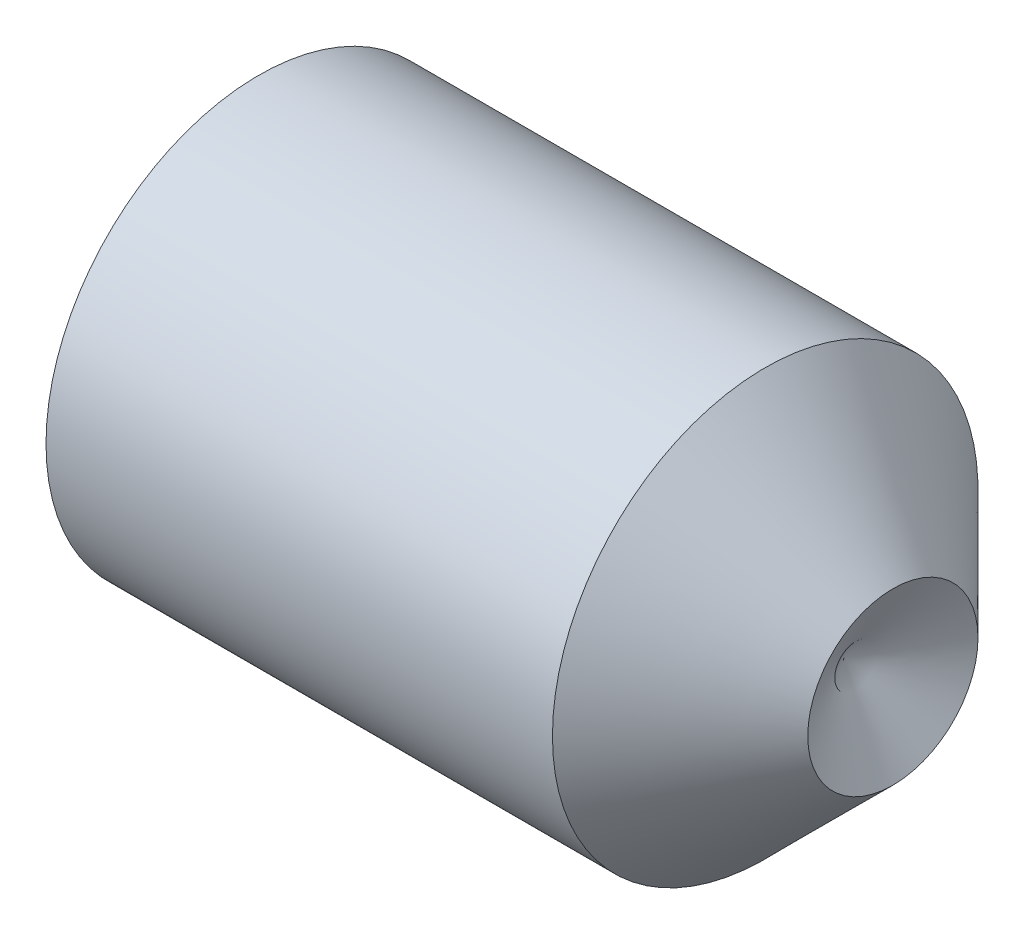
from build123d import *

# Parameters (mm, degrees)
HEX_2_DEPTH = 1.7


with BuildPart() as part:
    # BodySke → BaseBody (revolve)
    with BuildSketch(Plane.XY, mode=Mode.PRIVATE) as basebody_sk:
        Polygon((0, 0), (0, 0.774), (0.274818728, 1.25), (3.25, 1.25), (4, 0.5), (3.711324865, 0), align=None)
    revolve(basebody_sk.sketch.rotate(Axis((-12.7, 0, 0), (1, 0, 0)), 90), axis=Axis((-12.7, 0, 0), (1, 0, 0)))

    # Sketch2 → Hex 2 (cut)
    with BuildSketch(Plane.ZY):
        Polygon((0.259807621, 0.45), (-0.259807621, 0.45), (-0.519615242, 0), (-0.259807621, -0.45), (0.259807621, -0.45), (0.519615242, 0), align=None)
    extrude(amount=-HEX_2_DEPTH, mode=Mode.SUBTRACT)


solid = part.part
